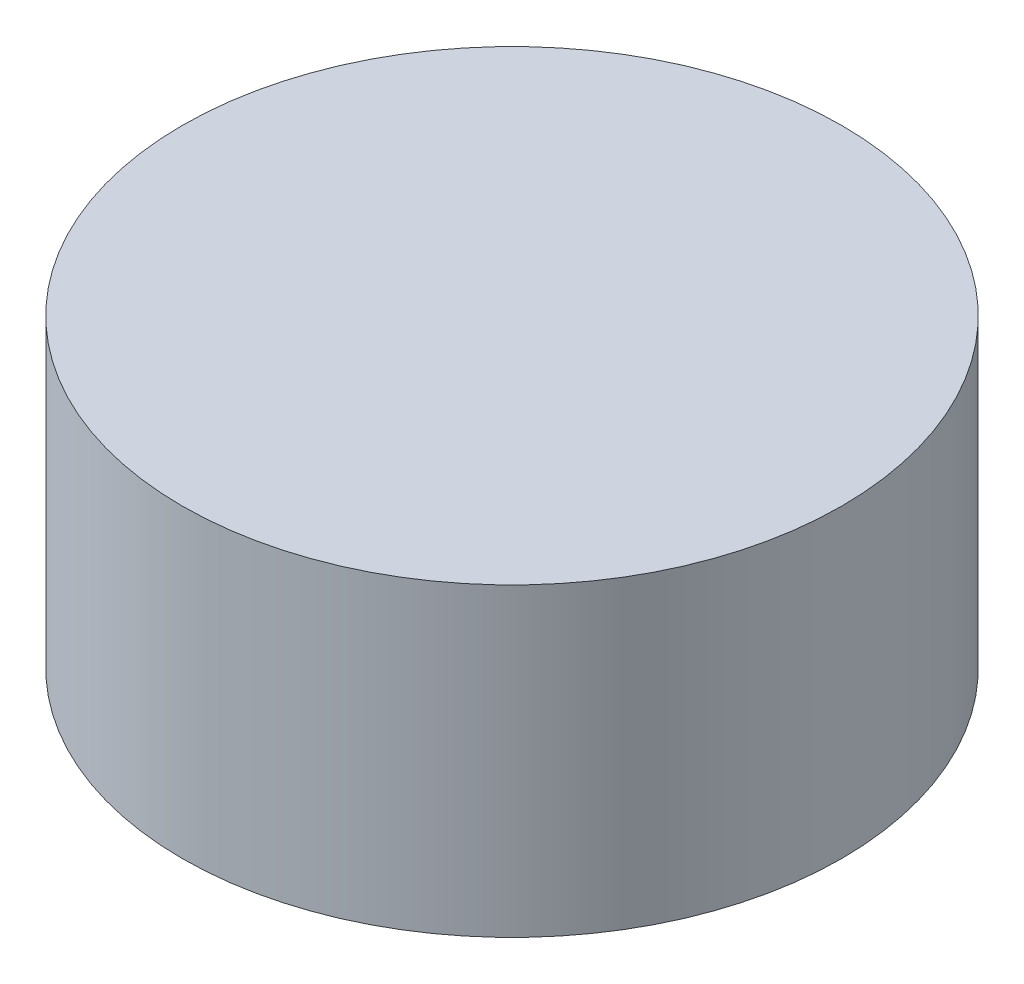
from build123d import *

# Parameters (mm, degrees)
SKETCH1_R           = 0.325
BOSS_EXTRUDE1_DEPTH = 1.41
SKETCH2_R           = 0.54
BOSS_EXTRUDE2_DEPTH = 0.5
CUT_EXTRUDE1_START  = 10
SKETCH7_R           = 0.54
CUT_EXTRUDE1_DEPTH  = 10


with BuildPart() as part:
    # Sketch1 → Boss-Extrude1 (new, symmetric)
    with BuildSketch(Plane(origin=(0, 0, 0), x_dir=(1, 0, 0), z_dir=(0, 1, 0))):
        with Locations(Location((0, 0, 0), (0, 0, 270))):
            Circle(SKETCH1_R)
    extrude(amount=BOSS_EXTRUDE1_DEPTH, both=True)

    # Sketch2 → Boss-Extrude2 (add)
    with BuildSketch(Plane(origin=(0, 1.41, 0), x_dir=(1, 0, 0), z_dir=(0, 1, 0))):
        with Locations(Location((0, 0, 0), (0, 0, 270))):
            Circle(SKETCH2_R)
    extrude(amount=BOSS_EXTRUDE2_DEPTH)

    # Sketch5 → Revolve1 (revolve)
    with BuildSketch(Plane(origin=(0, 0, 0), x_dir=(0, 0, -1), z_dir=(1, 0, 0))):
        with BuildLine():
            Line((0, -1.41), (0, -1.61))
            ThreePointArc((0, -1.61), (0.248999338, -1.583882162), (0.487159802, -1.50666555))
            Line((0.487159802, -1.50666555), (0.487159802, -1.40666555))
            ThreePointArc((0.487159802, -1.40666555), (0.406083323, -1.408499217), (0.325, -1.41))
            Line((0.325, -1.41), (0, -1.41))
        make_face()
    revolve(axis=Axis((0, -1.41, 0), (0, 1, 0)))

    # Sketch7 → Cut-Extrude1 (cut)
    with BuildSketch(Plane.XZ.offset(-1.41).offset(CUT_EXTRUDE1_START)):
        with Locations(Location((0, 0, 0), (0, 0, 90))):
            Circle(SKETCH7_R)
    extrude(amount=-CUT_EXTRUDE1_DEPTH, mode=Mode.SUBTRACT)


solid = part.part
